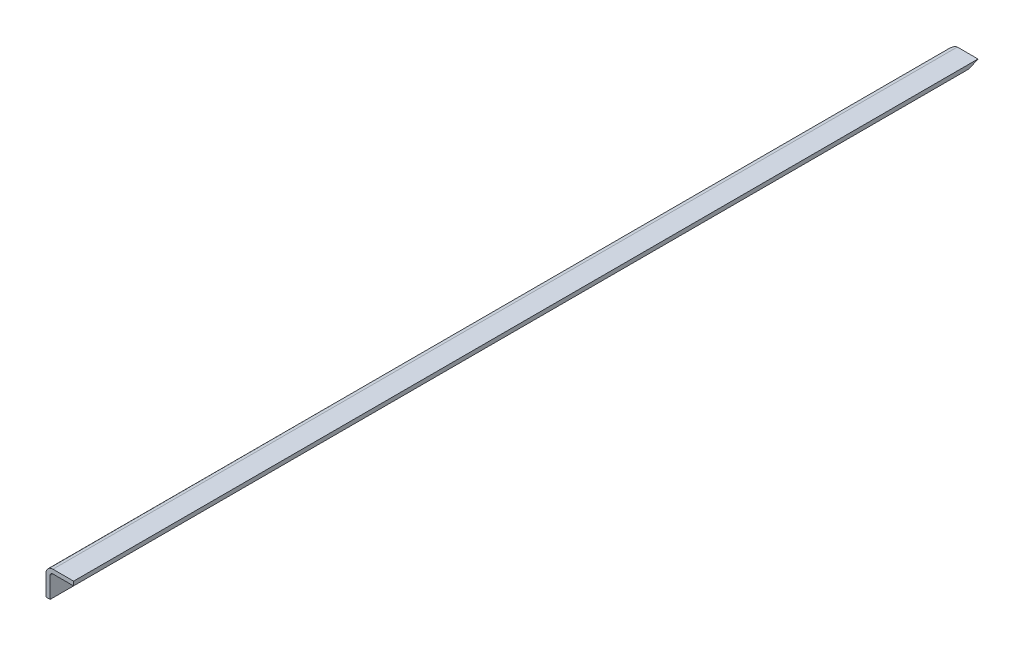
ISO-10303-21;
HEADER;
FILE_DESCRIPTION(('STEP AP214'),'2;1');
FILE_NAME('part.step','',(''),(''),'','','');
FILE_SCHEMA(('AUTOMOTIVE_DESIGN { 1 0 10303 214 1 1 1 1 }'));
ENDSEC;
DATA;
#1=APPLICATION_CONTEXT('core data for automotive mechanical design processes');
#2=APPLICATION_PROTOCOL_DEFINITION('international standard','automotive_design',2000,#1);
#3=PRODUCT_CONTEXT('',#1,'mechanical');
#4=PRODUCT('Part','Part','',(#3));
#5=PRODUCT_RELATED_PRODUCT_CATEGORY('part','',(#4));
#6=PRODUCT_DEFINITION_FORMATION('','',#4);
#7=PRODUCT_DEFINITION_CONTEXT('part definition',#1,'design');
#8=PRODUCT_DEFINITION('design','',#6,#7);
#9=PRODUCT_DEFINITION_SHAPE('','',#8);
#10=(LENGTH_UNIT() NAMED_UNIT(*) SI_UNIT(.MILLI.,.METRE.));
#11=(NAMED_UNIT(*) PLANE_ANGLE_UNIT() SI_UNIT($,.RADIAN.));
#12=(NAMED_UNIT(*) SI_UNIT($,.STERADIAN.) SOLID_ANGLE_UNIT());
#13=UNCERTAINTY_MEASURE_WITH_UNIT(LENGTH_MEASURE(1.E-05),#10,'distance_accuracy_value','');
#14=(GEOMETRIC_REPRESENTATION_CONTEXT(3) GLOBAL_UNCERTAINTY_ASSIGNED_CONTEXT((#13)) GLOBAL_UNIT_ASSIGNED_CONTEXT((#10,
#11,#12)) REPRESENTATION_CONTEXT('',''));
#15=CARTESIAN_POINT('',(0.,0.,0.));
#16=DIRECTION('',(0.,0.,1.));
#17=DIRECTION('',(1.,0.,0.));
#18=AXIS2_PLACEMENT_3D('',#15,#16,#17);
#19=CARTESIAN_POINT('',(12.,0.,2750.));
#20=DIRECTION('',(0.,1.,0.));
#21=DIRECTION('',(-1.,0.,0.));
#22=AXIS2_PLACEMENT_3D('',#19,#20,#21);
#23=PLANE('',#22);
#24=DIRECTION('',(0.,0.,-1.));
#25=VECTOR('',#24,1.);
#26=CARTESIAN_POINT('',(0.,0.,2750.));
#27=LINE('',#26,#25);
#28=CARTESIAN_POINT('',(0.,0.,2750.));
#29=VERTEX_POINT('',#28);
#30=CARTESIAN_POINT('',(0.,0.,300.));
#31=VERTEX_POINT('',#30);
#32=EDGE_CURVE('E161',#29,#31,#27,.T.);
#33=ORIENTED_EDGE('',*,*,#32,.T.);
#34=DIRECTION('',(1.,0.,0.));
#35=VECTOR('',#34,1.);
#36=CARTESIAN_POINT('',(-1.11022302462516E-13,0.,300.));
#37=LINE('',#36,#35);
#38=CARTESIAN_POINT('',(12.,0.,300.));
#39=VERTEX_POINT('',#38);
#40=EDGE_CURVE('E46',#31,#39,#37,.T.);
#41=ORIENTED_EDGE('',*,*,#40,.T.);
#42=DIRECTION('',(0.,0.,-1.));
#43=VECTOR('',#42,1.);
#44=CARTESIAN_POINT('',(12.,0.,2750.));
#45=LINE('',#44,#43);
#46=CARTESIAN_POINT('',(12.,0.,2750.));
#47=VERTEX_POINT('',#46);
#48=EDGE_CURVE('E11',#47,#39,#45,.T.);
#49=ORIENTED_EDGE('',*,*,#48,.F.);
#50=DIRECTION('',(1.,0.,0.));
#51=VECTOR('',#50,1.);
#52=CARTESIAN_POINT('',(12.,0.,2750.));
#53=LINE('',#52,#51);
#54=EDGE_CURVE('E145',#29,#47,#53,.T.);
#55=ORIENTED_EDGE('',*,*,#54,.F.);
#56=EDGE_LOOP('',(#33,#41,#49,#55));
#57=FACE_BOUND('',#56,.T.);
#58=ADVANCED_FACE('F32',(#57),#23,.F.);
#59=CARTESIAN_POINT('',(12.,59.9999999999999,2750.));
#60=DIRECTION('',(-1.,0.,0.));
#61=DIRECTION('',(0.,-1.,0.));
#62=AXIS2_PLACEMENT_3D('',#59,#60,#61);
#63=PLANE('',#62);
#64=ORIENTED_EDGE('',*,*,#48,.T.);
#65=DIRECTION('',(0.,0.422885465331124,-0.906183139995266));
#66=VECTOR('',#65,1.);
#67=CARTESIAN_POINT('',(12.,-928.138686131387,2288.86861313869));
#68=LINE('',#67,#66);
#69=CARTESIAN_POINT('',(12.,59.9999999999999,171.428571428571));
#70=VERTEX_POINT('',#69);
#71=EDGE_CURVE('E143',#39,#70,#68,.T.);
#72=ORIENTED_EDGE('',*,*,#71,.T.);
#73=DIRECTION('',(0.,0.,-1.));
#74=VECTOR('',#73,1.);
#75=CARTESIAN_POINT('',(12.,59.9999999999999,2750.));
#76=LINE('',#75,#74);
#77=CARTESIAN_POINT('',(12.,59.9999999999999,2750.));
#78=VERTEX_POINT('',#77);
#79=EDGE_CURVE('E39',#78,#70,#76,.T.);
#80=ORIENTED_EDGE('',*,*,#79,.F.);
#81=DIRECTION('',(0.,1.,0.));
#82=VECTOR('',#81,1.);
#83=CARTESIAN_POINT('',(12.,59.9999999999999,2750.));
#84=LINE('',#83,#82);
#85=EDGE_CURVE('E142',#47,#78,#84,.T.);
#86=ORIENTED_EDGE('',*,*,#85,.F.);
#87=EDGE_LOOP('',(#64,#72,#80,#86));
#88=FACE_BOUND('',#87,.T.);
#89=ADVANCED_FACE('F141',(#88),#63,.F.);
#90=CARTESIAN_POINT('',(20.,60.,2750.));
#91=DIRECTION('',(0.,0.,-1.));
#92=DIRECTION('',(-1.,0.,0.));
#93=AXIS2_PLACEMENT_3D('',#90,#91,#92);
#94=CYLINDRICAL_SURFACE('',#93,8.);
#95=ORIENTED_EDGE('',*,*,#79,.T.);
#96=CARTESIAN_POINT('',(20.,60.,171.428571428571));
#97=DIRECTION('',(0.,0.906183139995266,0.422885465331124));
#98=DIRECTION('',(0.,0.422885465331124,-0.906183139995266));
#99=AXIS2_PLACEMENT_3D('',#96,#97,#98);
#100=ELLIPSE('',#99,18.9176518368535,8.);
#101=CARTESIAN_POINT('',(20.0000000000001,68.,154.285714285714));
#102=VERTEX_POINT('',#101);
#103=EDGE_CURVE('E137',#70,#102,#100,.F.);
#104=ORIENTED_EDGE('',*,*,#103,.T.);
#105=DIRECTION('',(0.,0.,-1.));
#106=VECTOR('',#105,1.);
#107=CARTESIAN_POINT('',(20.0000000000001,68.,2750.));
#108=LINE('',#107,#106);
#109=CARTESIAN_POINT('',(20.0000000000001,68.,2750.));
#110=VERTEX_POINT('',#109);
#111=EDGE_CURVE('E123',#110,#102,#108,.T.);
#112=ORIENTED_EDGE('',*,*,#111,.F.);
#113=CARTESIAN_POINT('',(20.,60.,2750.));
#114=DIRECTION('',(0.,0.,-1.));
#115=DIRECTION('',(1.,0.,0.));
#116=AXIS2_PLACEMENT_3D('',#113,#114,#115);
#117=CIRCLE('',#116,8.);
#118=EDGE_CURVE('E138',#78,#110,#117,.T.);
#119=ORIENTED_EDGE('',*,*,#118,.F.);
#120=EDGE_LOOP('',(#95,#104,#112,#119));
#121=FACE_BOUND('',#120,.T.);
#122=ADVANCED_FACE('F135',(#121),#94,.F.);
#123=CARTESIAN_POINT('',(80.,68.,2750.));
#124=DIRECTION('',(0.,1.,0.));
#125=DIRECTION('',(-1.,0.,0.));
#126=AXIS2_PLACEMENT_3D('',#123,#124,#125);
#127=PLANE('',#126);
#128=ORIENTED_EDGE('',*,*,#111,.T.);
#129=DIRECTION('',(1.,0.,0.));
#130=VECTOR('',#129,1.);
#131=CARTESIAN_POINT('',(79.9999999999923,68.,154.285714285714));
#132=LINE('',#131,#130);
#133=CARTESIAN_POINT('',(80.,68.0000000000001,154.285714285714));
#134=VERTEX_POINT('',#133);
#135=EDGE_CURVE('E106',#102,#134,#132,.T.);
#136=ORIENTED_EDGE('',*,*,#135,.T.);
#137=DIRECTION('',(0.,0.,-1.));
#138=VECTOR('',#137,1.);
#139=CARTESIAN_POINT('',(80.,68.,2750.));
#140=LINE('',#139,#138);
#141=CARTESIAN_POINT('',(80.,68.,2750.));
#142=VERTEX_POINT('',#141);
#143=EDGE_CURVE('E116',#142,#134,#140,.T.);
#144=ORIENTED_EDGE('',*,*,#143,.F.);
#145=DIRECTION('',(1.,0.,0.));
#146=VECTOR('',#145,1.);
#147=CARTESIAN_POINT('',(80.,68.,2750.));
#148=LINE('',#147,#146);
#149=EDGE_CURVE('E153',#110,#142,#148,.T.);
#150=ORIENTED_EDGE('',*,*,#149,.F.);
#151=EDGE_LOOP('',(#128,#136,#144,#150));
#152=FACE_BOUND('',#151,.T.);
#153=ADVANCED_FACE('F173',(#152),#127,.F.);
#154=CARTESIAN_POINT('',(80.,80.,2750.));
#155=DIRECTION('',(-1.,0.,0.));
#156=DIRECTION('',(0.,-1.,0.));
#157=AXIS2_PLACEMENT_3D('',#154,#155,#156);
#158=PLANE('',#157);
#159=ORIENTED_EDGE('',*,*,#143,.T.);
#160=DIRECTION('',(0.,-0.422885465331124,0.906183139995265));
#161=VECTOR('',#160,1.);
#162=CARTESIAN_POINT('',(80.0000000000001,140.,0.));
#163=LINE('',#162,#161);
#164=CARTESIAN_POINT('',(80.,80.0000000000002,128.571428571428));
#165=VERTEX_POINT('',#164);
#166=EDGE_CURVE('E98',#165,#134,#163,.T.);
#167=ORIENTED_EDGE('',*,*,#166,.F.);
#168=DIRECTION('',(0.,0.,-1.));
#169=VECTOR('',#168,1.);
#170=CARTESIAN_POINT('',(80.,80.,2750.));
#171=LINE('',#170,#169);
#172=CARTESIAN_POINT('',(80.,80.,2750.));
#173=VERTEX_POINT('',#172);
#174=EDGE_CURVE('E113',#173,#165,#171,.T.);
#175=ORIENTED_EDGE('',*,*,#174,.F.);
#176=DIRECTION('',(0.,1.,0.));
#177=VECTOR('',#176,1.);
#178=CARTESIAN_POINT('',(80.,80.,2750.));
#179=LINE('',#178,#177);
#180=EDGE_CURVE('E155',#142,#173,#179,.T.);
#181=ORIENTED_EDGE('',*,*,#180,.F.);
#182=EDGE_LOOP('',(#159,#167,#175,#181));
#183=FACE_BOUND('',#182,.T.);
#184=ADVANCED_FACE('F111',(#183),#158,.F.);
#185=CARTESIAN_POINT('',(20.0000000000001,80.,2750.));
#186=DIRECTION('',(0.,-1.,0.));
#187=DIRECTION('',(0.,0.,-1.));
#188=AXIS2_PLACEMENT_3D('',#185,#186,#187);
#189=PLANE('',#188);
#190=ORIENTED_EDGE('',*,*,#174,.T.);
#191=DIRECTION('',(-1.,0.,0.));
#192=VECTOR('',#191,1.);
#193=CARTESIAN_POINT('',(19.9999999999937,80.,128.571428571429));
#194=LINE('',#193,#192);
#195=CARTESIAN_POINT('',(20.0000000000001,80.,128.571428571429));
#196=VERTEX_POINT('',#195);
#197=EDGE_CURVE('E95',#165,#196,#194,.T.);
#198=ORIENTED_EDGE('',*,*,#197,.T.);
#199=DIRECTION('',(0.,0.,-1.));
#200=VECTOR('',#199,1.);
#201=CARTESIAN_POINT('',(20.0000000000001,80.,2750.));
#202=LINE('',#201,#200);
#203=CARTESIAN_POINT('',(20.0000000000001,80.,2750.));
#204=VERTEX_POINT('',#203);
#205=EDGE_CURVE('E121',#204,#196,#202,.T.);
#206=ORIENTED_EDGE('',*,*,#205,.F.);
#207=DIRECTION('',(-1.,0.,0.));
#208=VECTOR('',#207,1.);
#209=CARTESIAN_POINT('',(20.0000000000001,80.,2750.));
#210=LINE('',#209,#208);
#211=EDGE_CURVE('E120',#173,#204,#210,.T.);
#212=ORIENTED_EDGE('',*,*,#211,.F.);
#213=EDGE_LOOP('',(#190,#198,#206,#212));
#214=FACE_BOUND('',#213,.T.);
#215=ADVANCED_FACE('F119',(#214),#189,.F.);
#216=CARTESIAN_POINT('',(20.,60.,2750.));
#217=DIRECTION('',(0.,0.,-1.));
#218=DIRECTION('',(-1.,0.,0.));
#219=AXIS2_PLACEMENT_3D('',#216,#217,#218);
#220=CYLINDRICAL_SURFACE('',#219,20.);
#221=ORIENTED_EDGE('',*,*,#205,.T.);
#222=CARTESIAN_POINT('',(20.,60.,171.428571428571));
#223=DIRECTION('',(0.,0.906183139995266,0.422885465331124));
#224=DIRECTION('',(0.,0.422885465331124,-0.906183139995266));
#225=AXIS2_PLACEMENT_3D('',#222,#223,#224);
#226=ELLIPSE('',#225,47.2941295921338,20.);
#227=CARTESIAN_POINT('',(0.,59.9999999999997,171.428571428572));
#228=VERTEX_POINT('',#227);
#229=EDGE_CURVE('E101',#196,#228,#226,.T.);
#230=ORIENTED_EDGE('',*,*,#229,.T.);
#231=DIRECTION('',(0.,0.,-1.));
#232=VECTOR('',#231,1.);
#233=CARTESIAN_POINT('',(0.,59.9999999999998,2750.));
#234=LINE('',#233,#232);
#235=CARTESIAN_POINT('',(0.,59.9999999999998,2750.));
#236=VERTEX_POINT('',#235);
#237=EDGE_CURVE('E125',#236,#228,#234,.T.);
#238=ORIENTED_EDGE('',*,*,#237,.F.);
#239=CARTESIAN_POINT('',(20.,60.,2750.));
#240=DIRECTION('',(0.,0.,1.));
#241=DIRECTION('',(-1.,0.,0.));
#242=AXIS2_PLACEMENT_3D('',#239,#240,#241);
#243=CIRCLE('',#242,20.);
#244=EDGE_CURVE('E158',#204,#236,#243,.T.);
#245=ORIENTED_EDGE('',*,*,#244,.F.);
#246=EDGE_LOOP('',(#221,#230,#238,#245));
#247=FACE_BOUND('',#246,.T.);
#248=ADVANCED_FACE('F169',(#247),#220,.T.);
#249=CARTESIAN_POINT('',(0.,0.,2750.));
#250=DIRECTION('',(1.,0.,0.));
#251=DIRECTION('',(0.,0.,-1.));
#252=AXIS2_PLACEMENT_3D('',#249,#250,#251);
#253=PLANE('',#252);
#254=ORIENTED_EDGE('',*,*,#237,.T.);
#255=DIRECTION('',(0.,-0.422885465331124,0.906183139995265));
#256=VECTOR('',#255,1.);
#257=CARTESIAN_POINT('',(1.11022302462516E-13,140.,0.));
#258=LINE('',#257,#256);
#259=EDGE_CURVE('E117',#228,#31,#258,.T.);
#260=ORIENTED_EDGE('',*,*,#259,.T.);
#261=ORIENTED_EDGE('',*,*,#32,.F.);
#262=DIRECTION('',(0.,-1.,0.));
#263=VECTOR('',#262,1.);
#264=CARTESIAN_POINT('',(0.,0.,2750.));
#265=LINE('',#264,#263);
#266=EDGE_CURVE('E54',#236,#29,#265,.T.);
#267=ORIENTED_EDGE('',*,*,#266,.F.);
#268=EDGE_LOOP('',(#254,#260,#261,#267));
#269=FACE_BOUND('',#268,.T.);
#270=ADVANCED_FACE('F166',(#269),#253,.F.);
#271=CARTESIAN_POINT('',(20.,60.,2750.));
#272=DIRECTION('',(0.,0.,-1.));
#273=DIRECTION('',(-1.,0.,0.));
#274=AXIS2_PLACEMENT_3D('',#271,#272,#273);
#275=PLANE('',#274);
#276=ORIENTED_EDGE('',*,*,#54,.T.);
#277=ORIENTED_EDGE('',*,*,#85,.T.);
#278=ORIENTED_EDGE('',*,*,#118,.T.);
#279=ORIENTED_EDGE('',*,*,#149,.T.);
#280=ORIENTED_EDGE('',*,*,#180,.T.);
#281=ORIENTED_EDGE('',*,*,#211,.T.);
#282=ORIENTED_EDGE('',*,*,#244,.T.);
#283=ORIENTED_EDGE('',*,*,#266,.T.);
#284=EDGE_LOOP('',(#276,#277,#278,#279,#280,#281,#282,#283));
#285=FACE_BOUND('',#284,.T.);
#286=ADVANCED_FACE('F175',(#285),#275,.F.);
#287=CARTESIAN_POINT('',(1.11022302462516E-13,140.,0.));
#288=DIRECTION('',(0.,0.906183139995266,0.422885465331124));
#289=DIRECTION('',(0.,-0.422885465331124,0.906183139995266));
#290=AXIS2_PLACEMENT_3D('',#287,#288,#289);
#291=PLANE('',#290);
#292=ORIENTED_EDGE('',*,*,#40,.F.);
#293=ORIENTED_EDGE('',*,*,#259,.F.);
#294=ORIENTED_EDGE('',*,*,#229,.F.);
#295=ORIENTED_EDGE('',*,*,#197,.F.);
#296=ORIENTED_EDGE('',*,*,#166,.T.);
#297=ORIENTED_EDGE('',*,*,#135,.F.);
#298=ORIENTED_EDGE('',*,*,#103,.F.);
#299=ORIENTED_EDGE('',*,*,#71,.F.);
#300=EDGE_LOOP('',(#292,#293,#294,#295,#296,#297,#298,#299));
#301=FACE_BOUND('',#300,.T.);
#302=ADVANCED_FACE('F97',(#301),#291,.F.);
#303=CLOSED_SHELL('',(#58,#89,#122,#153,#184,#215,#248,#270,#286,#302));
#304=MANIFOLD_SOLID_BREP('B2',#303);
#305=ADVANCED_BREP_SHAPE_REPRESENTATION('',(#18,#304),#14);
#306=SHAPE_DEFINITION_REPRESENTATION(#9,#305);
ENDSEC;
END-ISO-10303-21;
